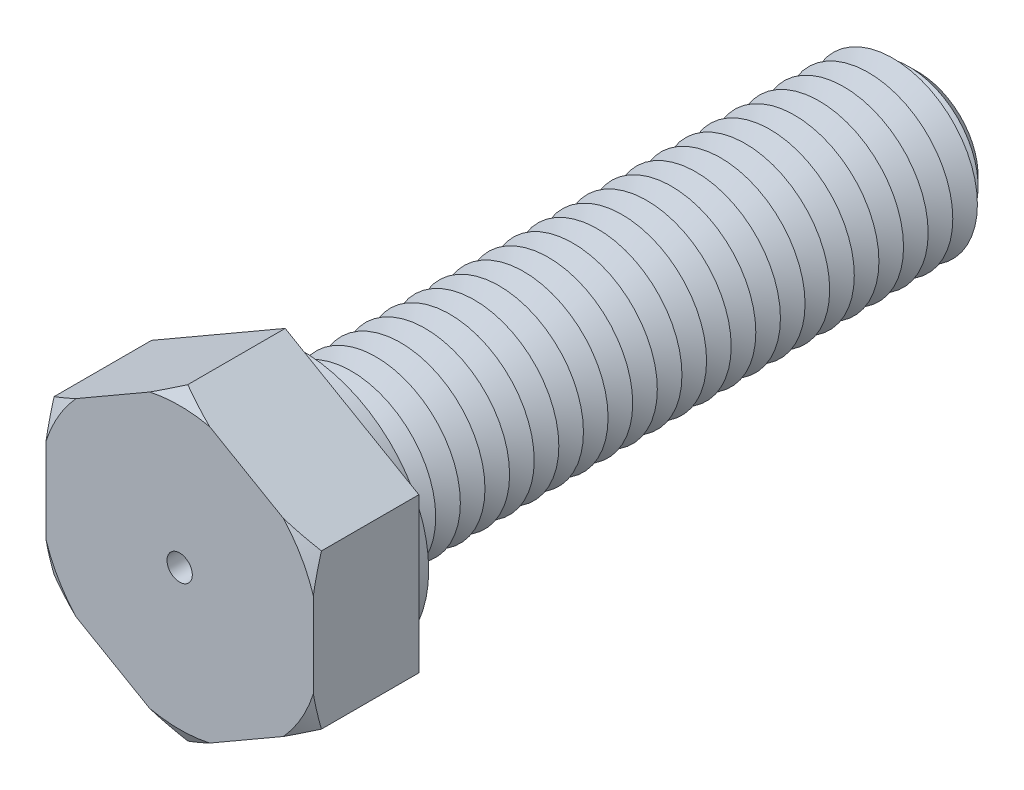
from build123d import *

# Parameters (mm, degrees)
BOSS_EXTRUDE1_DEPTH = 7.5
SKETCH3_R           = 6
BOSS_EXTRUDE2_DEPTH = 45
SKETCH4_R           = 9
BOSS_EXTRUDE3_DEPTH = 1.2
CHAMFER1_SIZE       = 1.75
LPATTERN1_COUNT     = 25
LPATTERN1_PITCH     = 1.75
SKETCH8_R           = 0.9
CUT_EXTRUDE1_DEPTH  = 52.5


with BuildPart() as part:
    # Sketch2 → Boss-Extrude1 (new body)
    with BuildSketch(Plane.XY):
        Polygon((0, 10.969655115), (-9.5, 5.484827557), (-9.5, -5.484827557), (0, -10.969655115), (9.5, -5.484827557), (9.5, 5.484827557), align=None)
    extrude(amount=BOSS_EXTRUDE1_DEPTH)

    # Sketch3 → Boss-Extrude2 (add)
    with BuildSketch(Plane(origin=(0, 0, 0), x_dir=(-1, 0, 0), z_dir=(0, 0, -1))):
        with Locations(Location((0, 0, 0), (0, 0, 180))):
            Circle(SKETCH3_R)
    extrude(amount=BOSS_EXTRUDE2_DEPTH)

    # Sketch4 → Boss-Extrude3 (add)
    with BuildSketch(Plane(origin=(0, 0, 0), x_dir=(-1, 0, 0), z_dir=(0, 0, -1))):
        with Locations(Location((0, 0, 0), (0, 0, 180))):
            Circle(SKETCH4_R)
    extrude(amount=BOSS_EXTRUDE3_DEPTH)

    # Chamfer1
    chamfer1_edges = [part.edges().sort_by_distance(p)[0] for p in [
        (-6, 0, -45),
    ]]
    chamfer(chamfer1_edges, length=CHAMFER1_SIZE)

    # Sketch6 → Cut-Revolve1 (revolve, cut)
    with BuildSketch(Plane(origin=(0, 0, 0), x_dir=(0, 0, -1), z_dir=(1, 0, 0)), mode=Mode.PRIVATE) as cut_revolve1_sk:
        Polygon((1.2, 6), (2.075, 4.484455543), (2.95, 6), align=None)
    cut_revolve1 = revolve(cut_revolve1_sk.sketch.rotate(Axis((0, 0, 3.211670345), (0, 0, -1)), 90), axis=Axis((0, 0, 3.211670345), (0, 0, -1)), mode=Mode.SUBTRACT)

    # LPattern1: Cut-Revolve1 ×25
    with Locations(*[(0, 0, -i * LPATTERN1_PITCH) for i in range(1, LPATTERN1_COUNT)]):
        add(cut_revolve1, mode=Mode.SUBTRACT)

    # Sketch7 → Cut-Revolve2 (revolve, cut)
    with BuildSketch(Plane(origin=(0, 0, 0), x_dir=(0, 0, -1), z_dir=(1, 0, 0)), mode=Mode.PRIVATE) as cut_revolve2_sk:
        Polygon((-7.5, 10.969655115), (-7.5, 9.969655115), (-6.922649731, 10.969655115), align=None)
    revolve(cut_revolve2_sk.sketch.rotate(Axis((0, 0, 3.211670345), (0, 0, -1)), 270), axis=Axis((0, 0, 3.211670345), (0, 0, -1)), mode=Mode.SUBTRACT)

    # Sketch8 → Cut-Extrude1 (cut)
    with BuildSketch(Plane.XY.offset(7.5)):
        Circle(SKETCH8_R)
    extrude(amount=-CUT_EXTRUDE1_DEPTH, mode=Mode.SUBTRACT)


solid = part.part
